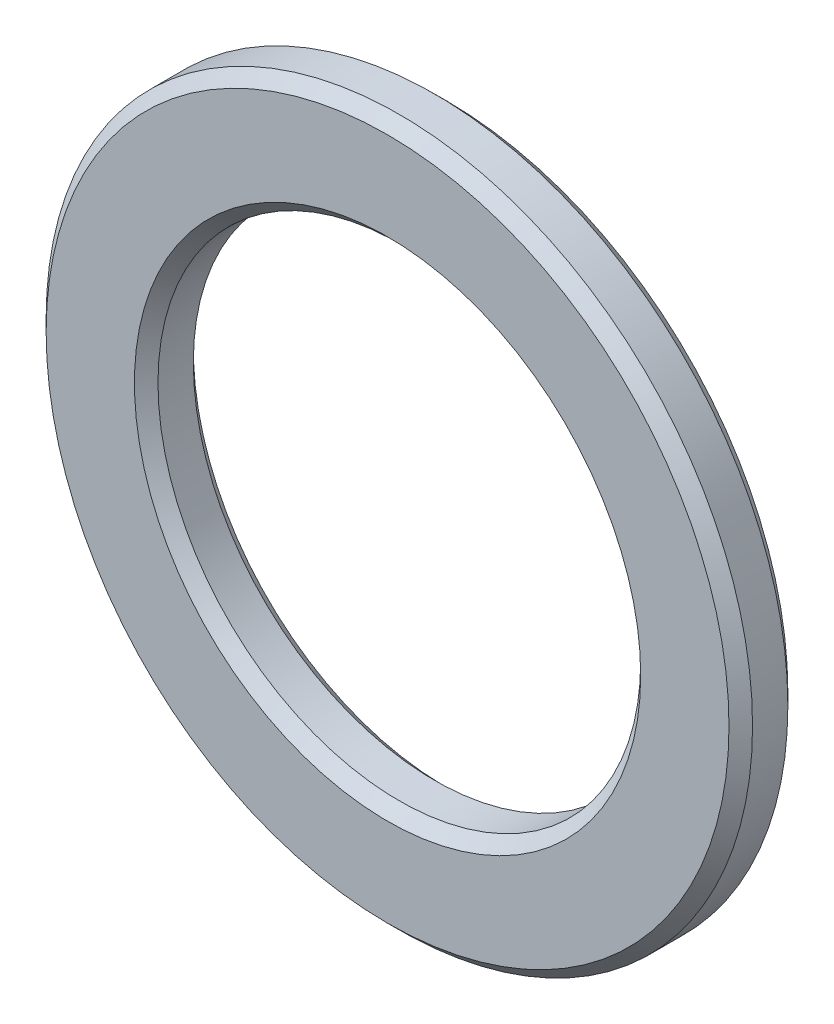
from build123d import *

# Parameters (mm, degrees)
SKETCH1_R           = 6
SKETCH1_R_2         = 4.1
BOSS_EXTRUDE2_DEPTH = 0.5
CHAMFER3_SIZE       = 0.2


with BuildPart() as part:
    # Sketch1 → Boss-Extrude2 (new, symmetric)
    with BuildSketch(Plane.XY):
        Circle(SKETCH1_R)
        Circle(SKETCH1_R_2, mode=Mode.SUBTRACT)
    extrude(amount=BOSS_EXTRUDE2_DEPTH, both=True)

    # Chamfer3
    chamfer3_edges = [part.edges().sort_by_distance(p)[0] for p in [
        (-6, 0, -0.5),
        (-6, 0, 0.5),
        (-4.1, 0, -0.5),
        (-4.1, 0, 0.5),
    ]]
    chamfer(chamfer3_edges, length=CHAMFER3_SIZE)


solid = part.part
